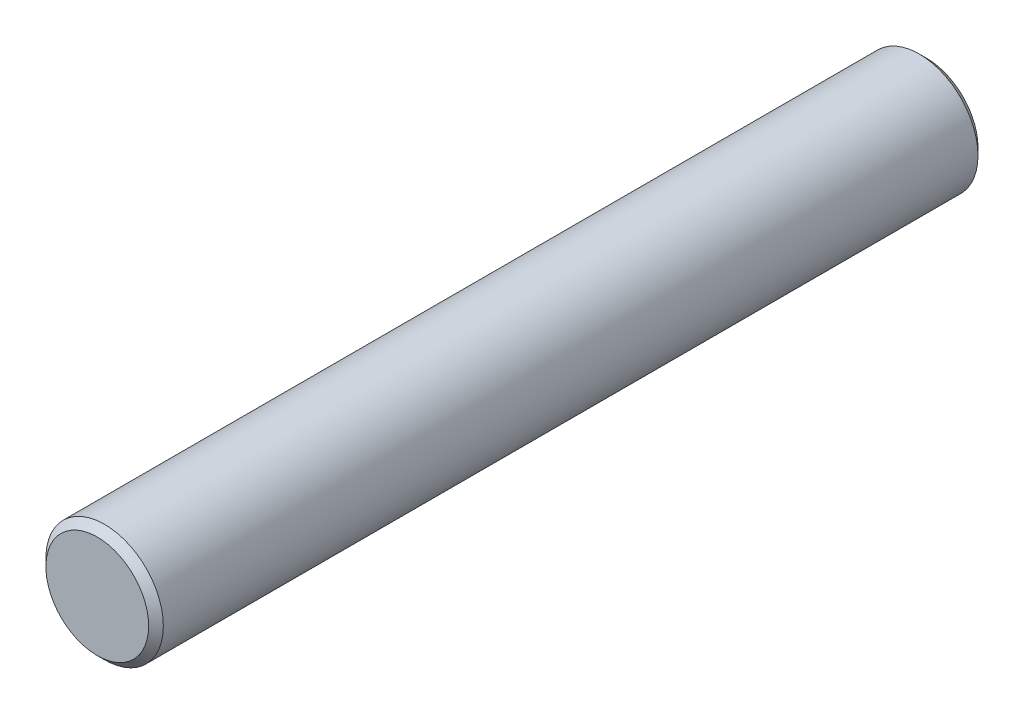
ISO-10303-21;
HEADER;
FILE_DESCRIPTION(('STEP AP214'),'2;1');
FILE_NAME('part.step','',(''),(''),'','','');
FILE_SCHEMA(('AUTOMOTIVE_DESIGN { 1 0 10303 214 1 1 1 1 }'));
ENDSEC;
DATA;
#1=APPLICATION_CONTEXT('core data for automotive mechanical design processes');
#2=APPLICATION_PROTOCOL_DEFINITION('international standard','automotive_design',2000,#1);
#3=PRODUCT_CONTEXT('',#1,'mechanical');
#4=PRODUCT('Part','Part','',(#3));
#5=PRODUCT_RELATED_PRODUCT_CATEGORY('part','',(#4));
#6=PRODUCT_DEFINITION_FORMATION('','',#4);
#7=PRODUCT_DEFINITION_CONTEXT('part definition',#1,'design');
#8=PRODUCT_DEFINITION('design','',#6,#7);
#9=PRODUCT_DEFINITION_SHAPE('','',#8);
#10=(LENGTH_UNIT() NAMED_UNIT(*) SI_UNIT(.MILLI.,.METRE.));
#11=(NAMED_UNIT(*) PLANE_ANGLE_UNIT() SI_UNIT($,.RADIAN.));
#12=(NAMED_UNIT(*) SI_UNIT($,.STERADIAN.) SOLID_ANGLE_UNIT());
#13=UNCERTAINTY_MEASURE_WITH_UNIT(LENGTH_MEASURE(1.E-05),#10,'distance_accuracy_value','');
#14=(GEOMETRIC_REPRESENTATION_CONTEXT(3) GLOBAL_UNCERTAINTY_ASSIGNED_CONTEXT((#13)) GLOBAL_UNIT_ASSIGNED_CONTEXT((#10,
#11,#12)) REPRESENTATION_CONTEXT('',''));
#15=CARTESIAN_POINT('',(0.,0.,0.));
#16=DIRECTION('',(0.,0.,1.));
#17=DIRECTION('',(1.,0.,0.));
#18=AXIS2_PLACEMENT_3D('',#15,#16,#17);
#19=CARTESIAN_POINT('',(0.,0.,27.75));
#20=DIRECTION('',(0.,0.,-1.));
#21=DIRECTION('',(-1.,0.,0.));
#22=AXIS2_PLACEMENT_3D('',#19,#20,#21);
#23=CONICAL_SURFACE('',#22,4.,0.785398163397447);
#24=CARTESIAN_POINT('',(0.,0.,28.25));
#25=DIRECTION('',(0.,0.,1.));
#26=DIRECTION('',(1.,0.,0.));
#27=AXIS2_PLACEMENT_3D('',#24,#25,#26);
#28=CIRCLE('',#27,3.5);
#29=CARTESIAN_POINT('',(3.5,0.,28.25));
#30=VERTEX_POINT('',#29);
#31=EDGE_CURVE('E43',#30,#30,#28,.T.);
#32=ORIENTED_EDGE('',*,*,#31,.F.);
#33=EDGE_LOOP('',(#32));
#34=FACE_BOUND('',#33,.T.);
#35=CARTESIAN_POINT('',(0.,0.,27.75));
#36=DIRECTION('',(0.,0.,1.));
#37=DIRECTION('',(1.,0.,0.));
#38=AXIS2_PLACEMENT_3D('',#35,#36,#37);
#39=CIRCLE('',#38,4.);
#40=CARTESIAN_POINT('',(4.,0.,27.75));
#41=VERTEX_POINT('',#40);
#42=EDGE_CURVE('E10',#41,#41,#39,.T.);
#43=ORIENTED_EDGE('',*,*,#42,.T.);
#44=EDGE_LOOP('',(#43));
#45=FACE_BOUND('',#44,.T.);
#46=ADVANCED_FACE('F29',(#34,#45),#23,.T.);
#47=CARTESIAN_POINT('',(0.,0.,35.5));
#48=DIRECTION('',(0.,0.,1.));
#49=DIRECTION('',(1.,0.,0.));
#50=AXIS2_PLACEMENT_3D('',#47,#48,#49);
#51=CYLINDRICAL_SURFACE('',#50,4.);
#52=ORIENTED_EDGE('',*,*,#42,.F.);
#53=EDGE_LOOP('',(#52));
#54=FACE_BOUND('',#53,.T.);
#55=CARTESIAN_POINT('',(0.,0.,-27.75));
#56=DIRECTION('',(0.,0.,1.));
#57=DIRECTION('',(1.,0.,0.));
#58=AXIS2_PLACEMENT_3D('',#55,#56,#57);
#59=CIRCLE('',#58,4.);
#60=CARTESIAN_POINT('',(4.,0.,-27.75));
#61=VERTEX_POINT('',#60);
#62=EDGE_CURVE('E35',#61,#61,#59,.T.);
#63=ORIENTED_EDGE('',*,*,#62,.T.);
#64=EDGE_LOOP('',(#63));
#65=FACE_BOUND('',#64,.T.);
#66=ADVANCED_FACE('F52',(#54,#65),#51,.T.);
#67=CARTESIAN_POINT('',(0.,0.,-28.25));
#68=DIRECTION('',(0.,0.,1.));
#69=DIRECTION('',(1.,0.,0.));
#70=AXIS2_PLACEMENT_3D('',#67,#68,#69);
#71=CONICAL_SURFACE('',#70,3.50000000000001,0.785398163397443);
#72=ORIENTED_EDGE('',*,*,#62,.F.);
#73=EDGE_LOOP('',(#72));
#74=FACE_BOUND('',#73,.T.);
#75=CARTESIAN_POINT('',(0.,0.,-28.25));
#76=DIRECTION('',(0.,0.,1.));
#77=DIRECTION('',(1.,0.,0.));
#78=AXIS2_PLACEMENT_3D('',#75,#76,#77);
#79=CIRCLE('',#78,3.50000000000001);
#80=CARTESIAN_POINT('',(3.50000000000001,0.,-28.25));
#81=VERTEX_POINT('',#80);
#82=EDGE_CURVE('E39',#81,#81,#79,.T.);
#83=ORIENTED_EDGE('',*,*,#82,.T.);
#84=EDGE_LOOP('',(#83));
#85=FACE_BOUND('',#84,.T.);
#86=ADVANCED_FACE('F56',(#74,#85),#71,.T.);
#87=CARTESIAN_POINT('',(0.,3.50000000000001,-28.25));
#88=DIRECTION('',(0.,0.,1.));
#89=DIRECTION('',(1.,0.,0.));
#90=AXIS2_PLACEMENT_3D('',#87,#88,#89);
#91=PLANE('',#90);
#92=ORIENTED_EDGE('',*,*,#82,.F.);
#93=EDGE_LOOP('',(#92));
#94=FACE_BOUND('',#93,.T.);
#95=ADVANCED_FACE('F61',(#94),#91,.F.);
#96=CARTESIAN_POINT('',(0.,0.,28.25));
#97=DIRECTION('',(0.,0.,-1.));
#98=DIRECTION('',(-1.,0.,0.));
#99=AXIS2_PLACEMENT_3D('',#96,#97,#98);
#100=PLANE('',#99);
#101=ORIENTED_EDGE('',*,*,#31,.T.);
#102=EDGE_LOOP('',(#101));
#103=FACE_BOUND('',#102,.T.);
#104=ADVANCED_FACE('F49',(#103),#100,.F.);
#105=CLOSED_SHELL('',(#46,#66,#86,#95,#104));
#106=MANIFOLD_SOLID_BREP('B2',#105);
#107=ADVANCED_BREP_SHAPE_REPRESENTATION('',(#18,#106),#14);
#108=SHAPE_DEFINITION_REPRESENTATION(#9,#107);
ENDSEC;
END-ISO-10303-21;
